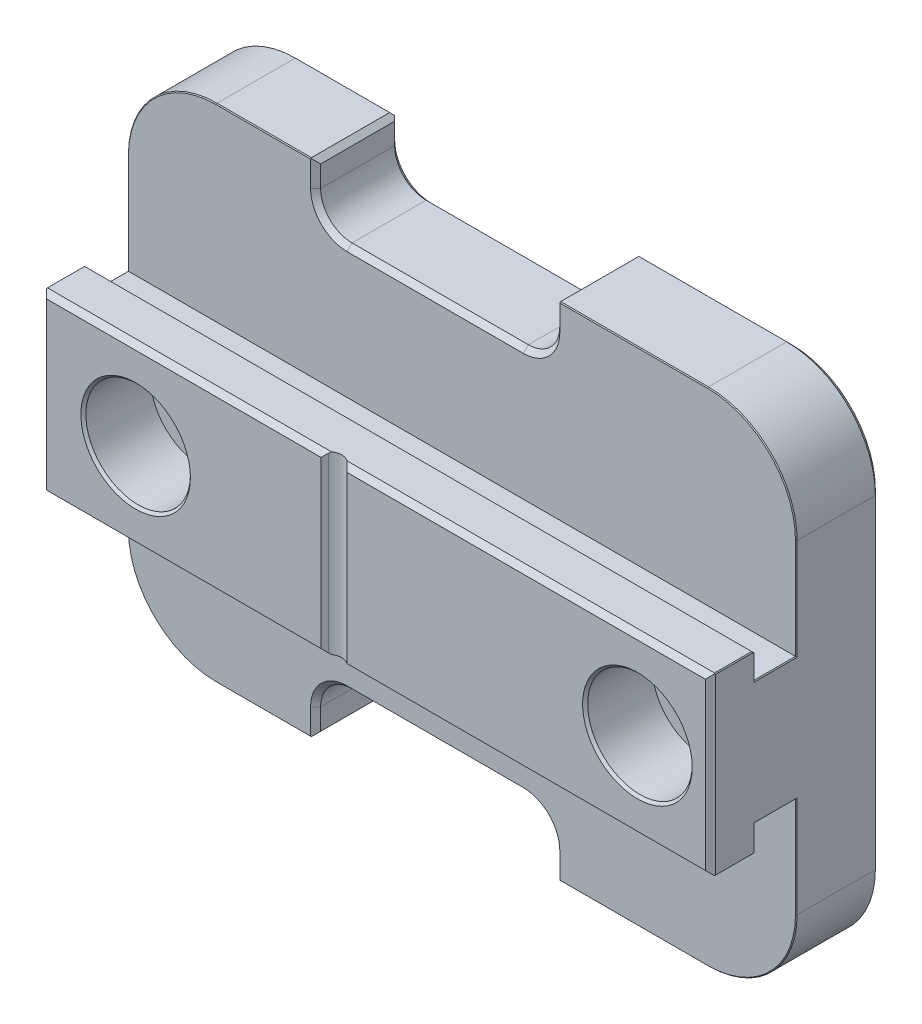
from build123d import *

# Parameters (mm, degrees)
EXTRUDE1_DEPTH     = 101.5492
CHAMFER1_SIZE      = 0.381
FILLET1_R          = 13.462
CUT_EXTRUDE1_DEPTH = 28.575
CHAMFER2_SIZE      = 0.762
CHAMFER3_SIZE      = 0.762
CHAMFER4_SIZE      = 0.254
CHAMFER5_SIZE      = 0.127
CHAMFER6_SIZE      = 0.127
SKETCH7_W          = 36.322
SKETCH7_H          = 14.477003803
CUT_EXTRUDE3_DEPTH = 25.4
FILLET3_R          = 4.7752
CHAMFER8_SIZE      = 0.762
CHAMFER9_SIZE      = 0.762
CHAMFER10_SIZE     = 0.762


with BuildPart() as part:
    # Sketch1 → Extrude1 (new body)
    with BuildSketch(Plane(origin=(0, 0, 0), x_dir=(0, 0, -1), z_dir=(1, 0, 0))):
        Polygon((-12.7635, -38.0746), (0, -38.0746), (0, 38.0746), (-12.7635, 38.0746), (-12.7635, 9.3726), (-19.1643, 9.3726), (-19.1643, 13.335), (-25.8191, 13.335), (-25.8191, -13.335), (-19.1643, -13.335), (-19.1643, -9.3726), (-12.7635, -9.3726), align=None)
    extrude(amount=-EXTRUDE1_DEPTH)

    # Sketch2 → Cut-Revolve1 (revolve, cut)
    with BuildSketch(Plane(origin=(0, 0, 0), x_dir=(1, 0, 0), z_dir=(0, 1, 0)), mode=Mode.PRIVATE) as cut_revolve1_sk:
        Polygon((-11.0744, -25.8191), (-11.0744, 2.175793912), (-16.4211, 2.175793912), (-16.4211, -15.6591), (-19.0119, -15.6591), (-19.0119, -25.8191), align=None)
    revolve(cut_revolve1_sk.sketch.rotate(Axis((-11.0744, 0, 33.403480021), (0, 0, -1)), 180), axis=Axis((-11.0744, 0, 33.403480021), (0, 0, -1)), mode=Mode.SUBTRACT)

    # Sketch3 → Cut-Revolve2 (revolve, cut)
    with BuildSketch(Plane(origin=(0, 0, 0), x_dir=(1, 0, 0), z_dir=(0, 1, 0)), mode=Mode.PRIVATE) as cut_revolve2_sk:
        Polygon((-87.2744, -25.8191), (-87.2744, 1.020549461), (-92.6338, 1.020549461), (-92.6338, -15.6591), (-95.2119, -15.6591), (-95.2119, -25.8191), align=None)
    revolve(cut_revolve2_sk.sketch.rotate(Axis((-87.2744, 0, 21.51059903), (0, 0, -1)), 180), axis=Axis((-87.2744, 0, 21.51059903), (0, 0, -1)), mode=Mode.SUBTRACT)

    # Chamfer1
    chamfer1_edges = [part.edges().sort_by_distance(p)[0] for p in [
        (-16.4211, 0, 0),
        (-19.0119, 0, 25.8191),
        (-92.6338, 0, 0),
        (-92.6338, 0, 15.6591),
        (-95.2119, 0, 25.8191),
    ]]
    chamfer(chamfer1_edges, length=CHAMFER1_SIZE)

    # Fillet1
    fillet1_edges = [part.edges().sort_by_distance(p)[0] for p in [
        (0, -38.0746, 6.38175),
        (0, 38.0746, 6.38175),
        (-101.5492, -38.0746, 6.38175),
        (-101.5492, 38.0746, 6.38175),
    ]]
    fillet(fillet1_edges, radius=FILLET1_R)

    # Sketch4 → Cut-Extrude1 (cut, symmetric)
    with BuildSketch(Plane(origin=(0, 0, 0), x_dir=(1, 0, 0), z_dir=(0, 1, 0))):
        with BuildLine():
            Line((-55.687759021, -25.274740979), (-51.38198628, -29.58051372))
            Line((-51.38198628, -29.58051372), (-62.86721372, -29.58051372))
            Line((-62.86721372, -29.58051372), (-58.561440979, -25.274740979))
            ThreePointArc((-58.561440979, -25.274740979), (-57.1246, -24.679581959), (-55.687759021, -25.274740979))
        make_face()
    extrude(amount=CUT_EXTRUDE1_DEPTH, both=True, mode=Mode.SUBTRACT)

    # Chamfer2
    chamfer2_edges = [part.edges().sort_by_distance(p)[0] for p in [
        (-50.7746, 38.0746, 0),
        (-101.5492, 0, 0),
        (0, 0, 0),
        (-50.7746, -38.0746, 0),
        (-97.606271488, -34.131671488, 0),
        (-3.942928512, -34.131671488, 0),
        (-3.942928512, 34.131671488, 0),
        (-97.606271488, 34.131671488, 0),
    ]]
    chamfer(chamfer2_edges, length=CHAMFER2_SIZE)

    # Chamfer3
    chamfer3_edges = [part.edges().sort_by_distance(p)[0] for p in [
        (-27.5717, 13.335, 25.8191),
        (-80.3275, -13.335, 25.8191),
        (0, 0, 25.8191),
        (-101.5492, 0, 25.8191),
        (-27.5717, -13.335, 25.8191),
        (-80.3275, 13.335, 25.8191),
    ]]
    chamfer(chamfer3_edges, length=CHAMFER3_SIZE)

    # Chamfer4
    chamfer4_edges = [part.edges().sort_by_distance(p)[0] for p in [
        (-50.7746, -13.335, 19.1643),
        (-50.7746, 13.335, 19.1643),
    ]]
    chamfer(chamfer4_edges, length=CHAMFER4_SIZE)

    # Chamfer5
    chamfer5_edges = [part.edges().sort_by_distance(p)[0] for p in [
        (0, -16.9926, 12.7635),
        (0, -9.3726, 15.9639),
        (-101.5492, 9.3726, 15.9639),
        (0, 9.3726, 15.9639),
        (-101.5492, -9.3726, 15.9639),
        (-101.5492, -16.9926, 12.7635),
        (-50.7746, 38.0746, 12.7635),
        (0, 16.9926, 12.7635),
        (-101.5492, 16.9926, 12.7635),
        (-3.942928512, 34.131671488, 12.7635),
        (-97.606271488, 34.131671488, 12.7635),
        (-50.7746, -38.0746, 12.7635),
        (-97.606271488, -34.131671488, 12.7635),
        (-3.942928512, -34.131671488, 12.7635),
    ]]
    chamfer(chamfer5_edges, length=CHAMFER5_SIZE)

    # Chamfer6
    chamfer6_edges = [part.edges().sort_by_distance(p)[0] for p in [
        (-101.5492, -13.335, 22.2377),
        (0, -13.335, 22.2377),
        (0, 13.335, 22.2377),
        (-101.5492, 13.335, 22.2377),
    ]]
    chamfer(chamfer6_edges, length=CHAMFER6_SIZE)

    # Sketch7 → Cut-Extrude3 (cut)
    with BuildSketch(Plane.XY.offset(12.7635)):
        with Locations((-54.8386, 36.550101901)):
            Rectangle(SKETCH7_W, SKETCH7_H)
    cut_extrude3 = extrude(amount=-CUT_EXTRUDE3_DEPTH, mode=Mode.SUBTRACT)

    # Mirror1: Cut-Extrude3 across plane
    add(cut_extrude3.mirror(Plane.ZX), mode=Mode.SUBTRACT)

    # Fillet3
    fillet3_edges = [part.edges().sort_by_distance(p)[0] for p in [
        (-72.9996, 29.3116, 6.38175),
        (-36.6776, 29.3116, 6.38175),
        (-72.9996, -29.3116, 6.38175),
        (-36.6776, -29.3116, 6.38175),
    ]]
    fillet(fillet3_edges, radius=FILLET3_R)

    # Chamfer8
    chamfer8_edges = [part.edges().sort_by_distance(p)[0] for p in [
        (-36.6776, -38.0746, 6.69925),
        (-72.9996, -38.0746, 6.69925),
        (-36.6776, 38.0746, 6.69925),
        (-72.9996, 38.0746, 6.69925),
    ]]
    chamfer(chamfer8_edges, length=CHAMFER8_SIZE)

    # Chamfer9
    chamfer9_edges = [part.edges().sort_by_distance(p)[0] for p in [
        (-72.9996, 35.6997, 12.7635),
        (-36.6776, 35.6997, 12.7635),
        (-71.600976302, 30.710223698, 12.7635),
        (-38.076223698, 30.710223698, 12.7635),
        (-54.8386, 29.3116, 12.7635),
        (-72.9996, -35.6997, 12.7635),
        (-36.6776, -35.6997, 12.7635),
        (-71.600976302, -30.710223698, 12.7635),
        (-38.076223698, -30.710223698, 12.7635),
        (-54.8386, -29.3116, 12.7635),
    ]]
    chamfer(chamfer9_edges, length=CHAMFER9_SIZE)

    # Chamfer10
    chamfer10_edges = [part.edges().sort_by_distance(p)[0] for p in [
        (-36.6776, 35.6997, 0),
        (-36.6776, -35.6997, 0),
        (-72.9996, -35.6997, 0),
        (-54.8386, -29.3116, 0),
        (-54.8386, 29.3116, 0),
        (-72.9996, 35.6997, 0),
        (-71.600976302, -30.710223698, 0),
        (-38.076223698, -30.710223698, 0),
        (-71.600976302, 30.710223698, 0),
        (-38.076223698, 30.710223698, 0),
    ]]
    chamfer(chamfer10_edges, length=CHAMFER10_SIZE)


solid = part.part
